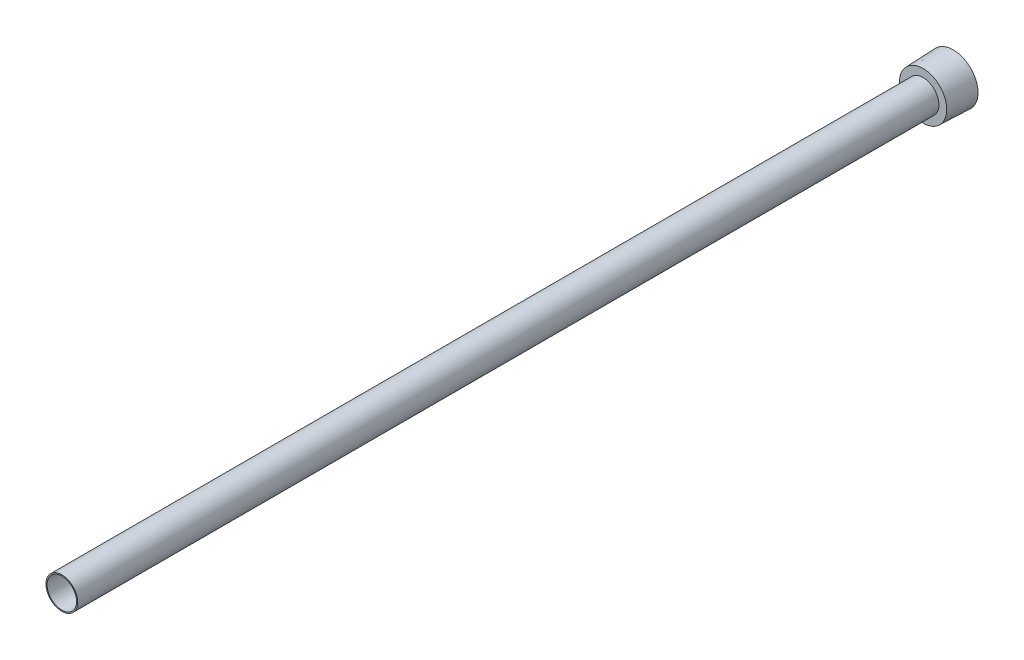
from build123d import *

# Parameters (mm, degrees)
SKETCH2_R          = 5.0419
CUT_EXTRUDE1_DEPTH = 306.035329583
CUT_EXTRUDE2_DEPTH = 6.35


with BuildPart() as part:
    # Sketch1 → Revolve1 (revolve)
    with BuildSketch(Plane(origin=(0, 0, 0), x_dir=(0, 0, -1), z_dir=(1, 0, 0)), mode=Mode.PRIVATE) as revolve1_sk:
        Polygon((0, 0), (0, 8.4709), (-10.3124, 8.094743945), (-10.3124, 5.4229), (-304.8, 5.4229), (-304.8, 0), align=None)
    revolve(revolve1_sk.sketch.rotate(Axis((0, 0, 168.793426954), (0, 0, -1)), 90), axis=Axis((0, 0, 168.793426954), (0, 0, -1)))

    # Sketch2 → Cut-Extrude1 (cut, through all)
    with BuildSketch(Plane.XY.offset(304.8)):
        Circle(SKETCH2_R)
    extrude(amount=-CUT_EXTRUDE1_DEPTH, mode=Mode.SUBTRACT)

    # Sketch3 → Cut-Extrude2 (cut)
    with BuildSketch(Plane(origin=(0, 0, 0), x_dir=(-1, 0, 0), z_dir=(0, 0, -1))):
        Polygon((0, -6.415804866), (5.55625, -3.207902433), (5.55625, 3.207902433), (0, 6.415804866), (-5.55625, 3.207902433), (-5.55625, -3.207902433), align=None)
    extrude(amount=-CUT_EXTRUDE2_DEPTH, mode=Mode.SUBTRACT)


solid = part.part
